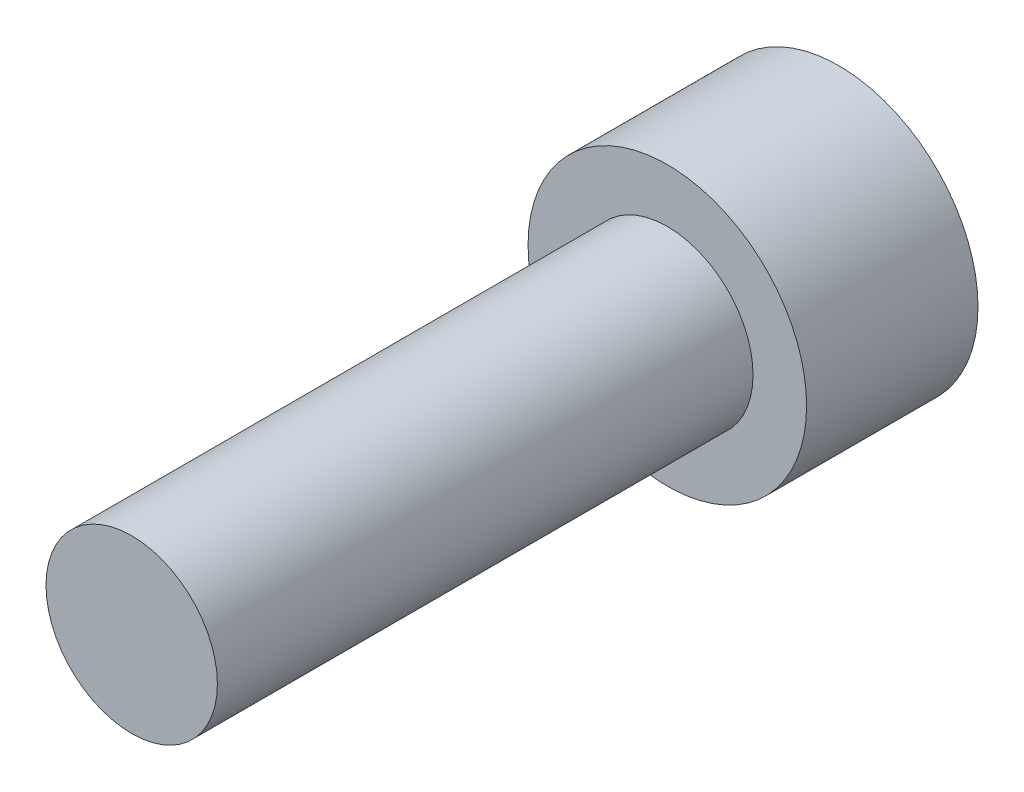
ISO-10303-21;
HEADER;
FILE_DESCRIPTION(('STEP AP214'),'2;1');
FILE_NAME('part.step','',(''),(''),'','','');
FILE_SCHEMA(('AUTOMOTIVE_DESIGN { 1 0 10303 214 1 1 1 1 }'));
ENDSEC;
DATA;
#1=APPLICATION_CONTEXT('core data for automotive mechanical design processes');
#2=APPLICATION_PROTOCOL_DEFINITION('international standard','automotive_design',2000,#1);
#3=PRODUCT_CONTEXT('',#1,'mechanical');
#4=PRODUCT('Part','Part','',(#3));
#5=PRODUCT_RELATED_PRODUCT_CATEGORY('part','',(#4));
#6=PRODUCT_DEFINITION_FORMATION('','',#4);
#7=PRODUCT_DEFINITION_CONTEXT('part definition',#1,'design');
#8=PRODUCT_DEFINITION('design','',#6,#7);
#9=PRODUCT_DEFINITION_SHAPE('','',#8);
#10=(LENGTH_UNIT() NAMED_UNIT(*) SI_UNIT(.MILLI.,.METRE.));
#11=(NAMED_UNIT(*) PLANE_ANGLE_UNIT() SI_UNIT($,.RADIAN.));
#12=(NAMED_UNIT(*) SI_UNIT($,.STERADIAN.) SOLID_ANGLE_UNIT());
#13=UNCERTAINTY_MEASURE_WITH_UNIT(LENGTH_MEASURE(1.E-05),#10,'distance_accuracy_value','');
#14=(GEOMETRIC_REPRESENTATION_CONTEXT(3) GLOBAL_UNCERTAINTY_ASSIGNED_CONTEXT((#13)) GLOBAL_UNIT_ASSIGNED_CONTEXT((#10,
#11,#12)) REPRESENTATION_CONTEXT('',''));
#15=CARTESIAN_POINT('',(0.,0.,0.));
#16=DIRECTION('',(0.,0.,1.));
#17=DIRECTION('',(1.,0.,0.));
#18=AXIS2_PLACEMENT_3D('',#15,#16,#17);
#19=CARTESIAN_POINT('',(0.,0.,8.));
#20=DIRECTION('',(0.,0.,1.));
#21=DIRECTION('',(1.,0.,0.));
#22=AXIS2_PLACEMENT_3D('',#19,#20,#21);
#23=PLANE('',#22);
#24=CARTESIAN_POINT('',(0.,0.,8.));
#25=DIRECTION('',(0.,0.,1.));
#26=DIRECTION('',(1.,0.,0.));
#27=AXIS2_PLACEMENT_3D('',#24,#25,#26);
#28=CIRCLE('',#27,6.5);
#29=CARTESIAN_POINT('',(6.5,0.,8.));
#30=VERTEX_POINT('',#29);
#31=EDGE_CURVE('E11',#30,#30,#28,.T.);
#32=ORIENTED_EDGE('',*,*,#31,.T.);
#33=EDGE_LOOP('',(#32));
#34=FACE_BOUND('',#33,.T.);
#35=CARTESIAN_POINT('',(0.,0.,8.));
#36=DIRECTION('',(0.,0.,1.));
#37=DIRECTION('',(1.,0.,0.));
#38=AXIS2_PLACEMENT_3D('',#35,#36,#37);
#39=CIRCLE('',#38,4.);
#40=CARTESIAN_POINT('',(4.,0.,8.));
#41=VERTEX_POINT('',#40);
#42=EDGE_CURVE('E134',#41,#41,#39,.T.);
#43=ORIENTED_EDGE('',*,*,#42,.F.);
#44=EDGE_LOOP('',(#43));
#45=FACE_BOUND('',#44,.T.);
#46=ADVANCED_FACE('F32',(#34,#45),#23,.T.);
#47=CARTESIAN_POINT('',(0.,0.,8.));
#48=DIRECTION('',(0.,0.,-1.));
#49=DIRECTION('',(-1.,0.,0.));
#50=AXIS2_PLACEMENT_3D('',#47,#48,#49);
#51=CYLINDRICAL_SURFACE('',#50,6.5);
#52=ORIENTED_EDGE('',*,*,#31,.F.);
#53=EDGE_LOOP('',(#52));
#54=FACE_BOUND('',#53,.T.);
#55=CARTESIAN_POINT('',(0.,0.,0.));
#56=DIRECTION('',(0.,0.,1.));
#57=DIRECTION('',(1.,0.,0.));
#58=AXIS2_PLACEMENT_3D('',#55,#56,#57);
#59=CIRCLE('',#58,6.5);
#60=CARTESIAN_POINT('',(6.5,0.,0.));
#61=VERTEX_POINT('',#60);
#62=EDGE_CURVE('E36',#61,#61,#59,.T.);
#63=ORIENTED_EDGE('',*,*,#62,.T.);
#64=EDGE_LOOP('',(#63));
#65=FACE_BOUND('',#64,.T.);
#66=ADVANCED_FACE('F34',(#54,#65),#51,.T.);
#67=CARTESIAN_POINT('',(0.,0.,0.));
#68=DIRECTION('',(0.,0.,1.));
#69=DIRECTION('',(1.,0.,0.));
#70=AXIS2_PLACEMENT_3D('',#67,#68,#69);
#71=PLANE('',#70);
#72=DIRECTION('',(0.967049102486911,0.254589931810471,0.));
#73=VECTOR('',#72,1.);
#74=CARTESIAN_POINT('',(-3.2516639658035,3.28024614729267,0.));
#75=LINE('',#74,#73);
#76=CARTESIAN_POINT('',(-3.2516639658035,3.28024614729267,0.));
#77=VERTEX_POINT('',#76);
#78=CARTESIAN_POINT('',(1.21494451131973,4.45614667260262,0.));
#79=VERTEX_POINT('',#78);
#80=EDGE_CURVE('E121',#77,#79,#75,.T.);
#81=ORIENTED_EDGE('',*,*,#80,.F.);
#82=DIRECTION('',(0.26304320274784,0.964784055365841,0.));
#83=VECTOR('',#82,1.);
#84=CARTESIAN_POINT('',(-4.46660847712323,-1.17590052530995,0.));
#85=LINE('',#84,#83);
#86=CARTESIAN_POINT('',(-4.46660847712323,-1.17590052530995,0.));
#87=VERTEX_POINT('',#86);
#88=EDGE_CURVE('E47',#87,#77,#85,.T.);
#89=ORIENTED_EDGE('',*,*,#88,.F.);
#90=DIRECTION('',(-0.704005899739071,0.710194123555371,0.));
#91=VECTOR('',#90,1.);
#92=CARTESIAN_POINT('',(-1.21494451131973,-4.45614667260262,0.));
#93=LINE('',#92,#91);
#94=CARTESIAN_POINT('',(-1.21494451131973,-4.45614667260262,0.));
#95=VERTEX_POINT('',#94);
#96=EDGE_CURVE('E130',#95,#87,#93,.T.);
#97=ORIENTED_EDGE('',*,*,#96,.F.);
#98=DIRECTION('',(-0.967049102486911,-0.254589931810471,0.));
#99=VECTOR('',#98,1.);
#100=CARTESIAN_POINT('',(3.2516639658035,-3.28024614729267,0.));
#101=LINE('',#100,#99);
#102=CARTESIAN_POINT('',(3.2516639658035,-3.28024614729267,0.));
#103=VERTEX_POINT('',#102);
#104=EDGE_CURVE('E128',#103,#95,#101,.T.);
#105=ORIENTED_EDGE('',*,*,#104,.F.);
#106=DIRECTION('',(-0.26304320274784,-0.964784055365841,0.));
#107=VECTOR('',#106,1.);
#108=CARTESIAN_POINT('',(4.46660847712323,1.17590052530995,0.));
#109=LINE('',#108,#107);
#110=CARTESIAN_POINT('',(4.46660847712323,1.17590052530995,0.));
#111=VERTEX_POINT('',#110);
#112=EDGE_CURVE('E95',#111,#103,#109,.T.);
#113=ORIENTED_EDGE('',*,*,#112,.F.);
#114=DIRECTION('',(0.704005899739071,-0.710194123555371,0.));
#115=VECTOR('',#114,1.);
#116=CARTESIAN_POINT('',(1.21494451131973,4.45614667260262,0.));
#117=LINE('',#116,#115);
#118=EDGE_CURVE('E124',#79,#111,#117,.T.);
#119=ORIENTED_EDGE('',*,*,#118,.F.);
#120=EDGE_LOOP('',(#81,#89,#97,#105,#113,#119));
#121=FACE_BOUND('',#120,.T.);
#122=ORIENTED_EDGE('',*,*,#62,.F.);
#123=EDGE_LOOP('',(#122));
#124=FACE_BOUND('',#123,.T.);
#125=ADVANCED_FACE('F154',(#121,#124),#71,.F.);
#126=CARTESIAN_POINT('',(0.,0.,33.));
#127=DIRECTION('',(0.,0.,-1.));
#128=DIRECTION('',(-1.,0.,0.));
#129=AXIS2_PLACEMENT_3D('',#126,#127,#128);
#130=CYLINDRICAL_SURFACE('',#129,4.);
#131=CARTESIAN_POINT('',(0.,0.,33.));
#132=DIRECTION('',(0.,0.,1.));
#133=DIRECTION('',(1.,0.,0.));
#134=AXIS2_PLACEMENT_3D('',#131,#132,#133);
#135=CIRCLE('',#134,4.);
#136=CARTESIAN_POINT('',(4.,0.,33.));
#137=VERTEX_POINT('',#136);
#138=EDGE_CURVE('E140',#137,#137,#135,.T.);
#139=ORIENTED_EDGE('',*,*,#138,.F.);
#140=EDGE_LOOP('',(#139));
#141=FACE_BOUND('',#140,.T.);
#142=ORIENTED_EDGE('',*,*,#42,.T.);
#143=EDGE_LOOP('',(#142));
#144=FACE_BOUND('',#143,.T.);
#145=ADVANCED_FACE('F146',(#141,#144),#130,.T.);
#146=CARTESIAN_POINT('',(0.,0.,33.));
#147=DIRECTION('',(0.,0.,1.));
#148=DIRECTION('',(1.,0.,0.));
#149=AXIS2_PLACEMENT_3D('',#146,#147,#148);
#150=PLANE('',#149);
#151=ORIENTED_EDGE('',*,*,#138,.T.);
#152=EDGE_LOOP('',(#151));
#153=FACE_BOUND('',#152,.T.);
#154=ADVANCED_FACE('F163',(#153),#150,.T.);
#155=CARTESIAN_POINT('',(-4.46660847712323,-1.17590052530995,7.5));
#156=DIRECTION('',(-0.964784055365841,0.26304320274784,0.));
#157=DIRECTION('',(-0.26304320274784,-0.964784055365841,0.));
#158=AXIS2_PLACEMENT_3D('',#155,#156,#157);
#159=PLANE('',#158);
#160=ORIENTED_EDGE('',*,*,#88,.T.);
#161=DIRECTION('',(0.,0.,-1.));
#162=VECTOR('',#161,1.);
#163=CARTESIAN_POINT('',(-3.2516639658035,3.28024614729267,7.5));
#164=LINE('',#163,#162);
#165=CARTESIAN_POINT('',(-3.2516639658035,3.28024614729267,7.5));
#166=VERTEX_POINT('',#165);
#167=EDGE_CURVE('E77',#166,#77,#164,.T.);
#168=ORIENTED_EDGE('',*,*,#167,.F.);
#169=DIRECTION('',(0.26304320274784,0.964784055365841,0.));
#170=VECTOR('',#169,1.);
#171=CARTESIAN_POINT('',(-4.46660847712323,-1.17590052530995,7.5));
#172=LINE('',#171,#170);
#173=CARTESIAN_POINT('',(-4.46660847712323,-1.17590052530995,7.5));
#174=VERTEX_POINT('',#173);
#175=EDGE_CURVE('E132',#174,#166,#172,.T.);
#176=ORIENTED_EDGE('',*,*,#175,.F.);
#177=DIRECTION('',(0.,0.,-1.));
#178=VECTOR('',#177,1.);
#179=CARTESIAN_POINT('',(-4.46660847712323,-1.17590052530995,7.5));
#180=LINE('',#179,#178);
#181=EDGE_CURVE('E55',#174,#87,#180,.T.);
#182=ORIENTED_EDGE('',*,*,#181,.T.);
#183=EDGE_LOOP('',(#160,#168,#176,#182));
#184=FACE_BOUND('',#183,.T.);
#185=ADVANCED_FACE('F175',(#184),#159,.F.);
#186=CARTESIAN_POINT('',(-1.21494451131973,-4.45614667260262,7.5));
#187=DIRECTION('',(-0.710194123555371,-0.704005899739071,0.));
#188=DIRECTION('',(0.704005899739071,-0.710194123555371,0.));
#189=AXIS2_PLACEMENT_3D('',#186,#187,#188);
#190=PLANE('',#189);
#191=ORIENTED_EDGE('',*,*,#96,.T.);
#192=ORIENTED_EDGE('',*,*,#181,.F.);
#193=DIRECTION('',(-0.704005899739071,0.710194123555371,0.));
#194=VECTOR('',#193,1.);
#195=CARTESIAN_POINT('',(-1.21494451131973,-4.45614667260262,7.5));
#196=LINE('',#195,#194);
#197=CARTESIAN_POINT('',(-1.21494451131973,-4.45614667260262,7.5));
#198=VERTEX_POINT('',#197);
#199=EDGE_CURVE('E107',#198,#174,#196,.T.);
#200=ORIENTED_EDGE('',*,*,#199,.F.);
#201=DIRECTION('',(0.,0.,-1.));
#202=VECTOR('',#201,1.);
#203=CARTESIAN_POINT('',(-1.21494451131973,-4.45614667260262,7.5));
#204=LINE('',#203,#202);
#205=EDGE_CURVE('E99',#198,#95,#204,.T.);
#206=ORIENTED_EDGE('',*,*,#205,.T.);
#207=EDGE_LOOP('',(#191,#192,#200,#206));
#208=FACE_BOUND('',#207,.T.);
#209=ADVANCED_FACE('F177',(#208),#190,.F.);
#210=CARTESIAN_POINT('',(3.2516639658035,-3.28024614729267,7.5));
#211=DIRECTION('',(0.254589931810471,-0.967049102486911,0.));
#212=DIRECTION('',(0.967049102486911,0.254589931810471,0.));
#213=AXIS2_PLACEMENT_3D('',#210,#211,#212);
#214=PLANE('',#213);
#215=ORIENTED_EDGE('',*,*,#104,.T.);
#216=ORIENTED_EDGE('',*,*,#205,.F.);
#217=DIRECTION('',(-0.967049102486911,-0.254589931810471,0.));
#218=VECTOR('',#217,1.);
#219=CARTESIAN_POINT('',(3.2516639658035,-3.28024614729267,7.5));
#220=LINE('',#219,#218);
#221=CARTESIAN_POINT('',(3.2516639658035,-3.28024614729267,7.5));
#222=VERTEX_POINT('',#221);
#223=EDGE_CURVE('E103',#222,#198,#220,.T.);
#224=ORIENTED_EDGE('',*,*,#223,.F.);
#225=DIRECTION('',(0.,0.,-1.));
#226=VECTOR('',#225,1.);
#227=CARTESIAN_POINT('',(3.2516639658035,-3.28024614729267,7.5));
#228=LINE('',#227,#226);
#229=EDGE_CURVE('E88',#222,#103,#228,.T.);
#230=ORIENTED_EDGE('',*,*,#229,.T.);
#231=EDGE_LOOP('',(#215,#216,#224,#230));
#232=FACE_BOUND('',#231,.T.);
#233=ADVANCED_FACE('F104',(#232),#214,.F.);
#234=CARTESIAN_POINT('',(4.46660847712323,1.17590052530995,7.5));
#235=DIRECTION('',(0.964784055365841,-0.26304320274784,0.));
#236=DIRECTION('',(0.26304320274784,0.964784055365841,0.));
#237=AXIS2_PLACEMENT_3D('',#234,#235,#236);
#238=PLANE('',#237);
#239=ORIENTED_EDGE('',*,*,#112,.T.);
#240=ORIENTED_EDGE('',*,*,#229,.F.);
#241=DIRECTION('',(-0.26304320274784,-0.964784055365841,0.));
#242=VECTOR('',#241,1.);
#243=CARTESIAN_POINT('',(4.46660847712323,1.17590052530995,7.5));
#244=LINE('',#243,#242);
#245=CARTESIAN_POINT('',(4.46660847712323,1.17590052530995,7.5));
#246=VERTEX_POINT('',#245);
#247=EDGE_CURVE('E92',#246,#222,#244,.T.);
#248=ORIENTED_EDGE('',*,*,#247,.F.);
#249=DIRECTION('',(0.,0.,-1.));
#250=VECTOR('',#249,1.);
#251=CARTESIAN_POINT('',(4.46660847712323,1.17590052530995,7.5));
#252=LINE('',#251,#250);
#253=EDGE_CURVE('E100',#246,#111,#252,.T.);
#254=ORIENTED_EDGE('',*,*,#253,.T.);
#255=EDGE_LOOP('',(#239,#240,#248,#254));
#256=FACE_BOUND('',#255,.T.);
#257=ADVANCED_FACE('F90',(#256),#238,.F.);
#258=CARTESIAN_POINT('',(1.21494451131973,4.45614667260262,7.5));
#259=DIRECTION('',(0.710194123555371,0.704005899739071,0.));
#260=DIRECTION('',(-0.704005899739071,0.710194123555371,0.));
#261=AXIS2_PLACEMENT_3D('',#258,#259,#260);
#262=PLANE('',#261);
#263=ORIENTED_EDGE('',*,*,#118,.T.);
#264=ORIENTED_EDGE('',*,*,#253,.F.);
#265=DIRECTION('',(0.704005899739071,-0.710194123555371,0.));
#266=VECTOR('',#265,1.);
#267=CARTESIAN_POINT('',(1.21494451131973,4.45614667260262,7.5));
#268=LINE('',#267,#266);
#269=CARTESIAN_POINT('',(1.21494451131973,4.45614667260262,7.5));
#270=VERTEX_POINT('',#269);
#271=EDGE_CURVE('E113',#270,#246,#268,.T.);
#272=ORIENTED_EDGE('',*,*,#271,.F.);
#273=DIRECTION('',(0.,0.,-1.));
#274=VECTOR('',#273,1.);
#275=CARTESIAN_POINT('',(1.21494451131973,4.45614667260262,7.5));
#276=LINE('',#275,#274);
#277=EDGE_CURVE('E137',#270,#79,#276,.T.);
#278=ORIENTED_EDGE('',*,*,#277,.T.);
#279=EDGE_LOOP('',(#263,#264,#272,#278));
#280=FACE_BOUND('',#279,.T.);
#281=ADVANCED_FACE('F188',(#280),#262,.F.);
#282=CARTESIAN_POINT('',(-3.2516639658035,3.28024614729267,7.5));
#283=DIRECTION('',(-0.254589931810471,0.967049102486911,0.));
#284=DIRECTION('',(-0.967049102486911,-0.254589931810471,0.));
#285=AXIS2_PLACEMENT_3D('',#282,#283,#284);
#286=PLANE('',#285);
#287=ORIENTED_EDGE('',*,*,#80,.T.);
#288=ORIENTED_EDGE('',*,*,#277,.F.);
#289=DIRECTION('',(0.967049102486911,0.254589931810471,0.));
#290=VECTOR('',#289,1.);
#291=CARTESIAN_POINT('',(-3.2516639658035,3.28024614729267,7.5));
#292=LINE('',#291,#290);
#293=EDGE_CURVE('E115',#166,#270,#292,.T.);
#294=ORIENTED_EDGE('',*,*,#293,.F.);
#295=ORIENTED_EDGE('',*,*,#167,.T.);
#296=EDGE_LOOP('',(#287,#288,#294,#295));
#297=FACE_BOUND('',#296,.T.);
#298=ADVANCED_FACE('F173',(#297),#286,.F.);
#299=CARTESIAN_POINT('',(-3.2516639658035,3.28024614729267,7.5));
#300=DIRECTION('',(0.,0.,-1.));
#301=DIRECTION('',(-1.,0.,0.));
#302=AXIS2_PLACEMENT_3D('',#299,#300,#301);
#303=PLANE('',#302);
#304=ORIENTED_EDGE('',*,*,#175,.T.);
#305=ORIENTED_EDGE('',*,*,#293,.T.);
#306=ORIENTED_EDGE('',*,*,#271,.T.);
#307=ORIENTED_EDGE('',*,*,#247,.T.);
#308=ORIENTED_EDGE('',*,*,#223,.T.);
#309=ORIENTED_EDGE('',*,*,#199,.T.);
#310=EDGE_LOOP('',(#304,#305,#306,#307,#308,#309));
#311=FACE_BOUND('',#310,.T.);
#312=ADVANCED_FACE('F110',(#311),#303,.T.);
#313=CLOSED_SHELL('',(#46,#66,#125,#145,#154,#185,#209,#233,#257,#281,#298,#312));
#314=MANIFOLD_SOLID_BREP('B2',#313);
#315=ADVANCED_BREP_SHAPE_REPRESENTATION('',(#18,#314),#14);
#316=SHAPE_DEFINITION_REPRESENTATION(#9,#315);
ENDSEC;
END-ISO-10303-21;
